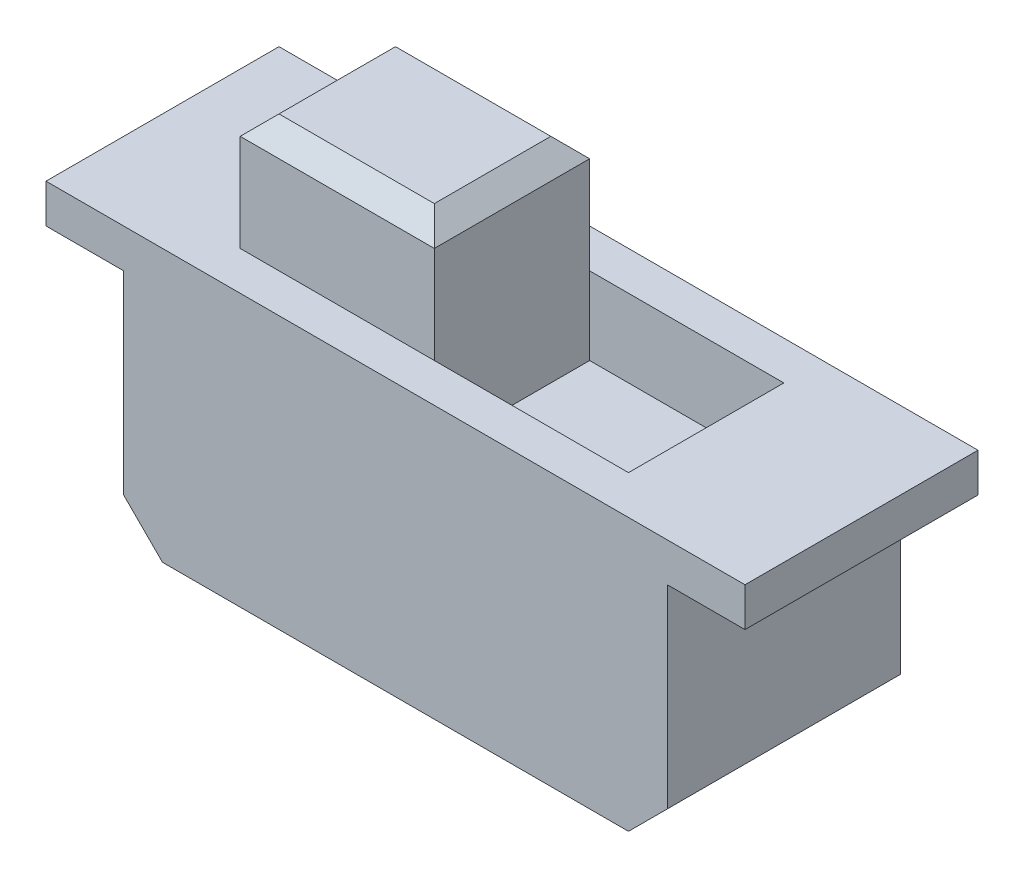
from build123d import *

# Parameters (mm, degrees)
EXTRUSION1_DEPTH        = 6
ESQUISSE2_W             = 10
ESQUISSE2_H             = 4
ENL_V_MAT_EXTRU_1_DEPTH = 2
ESQUISSE3_W             = 5
ESQUISSE3_H             = 4
EXTRUSION2_DEPTH        = 5
CHANFREIN1_SIZE         = 0.5


with BuildPart() as part:
    # Esquisse1 → Extrusion1 (new body)
    with BuildSketch(Plane.XY):
        Polygon((-9, 0), (9, 0), (9, -1), (7, -1), (7, -6), (6, -7), (-6, -7), (-7, -6), (-7, -1), (-9, -1), align=None)
    extrude(amount=EXTRUSION1_DEPTH)

    # Esquisse2 → Enl_v. mat.-Extru.1 (cut)
    with BuildSketch(Plane(origin=(0, 0, 0), x_dir=(-1, 0, 0), z_dir=(0, 1, 0))):
        with Locations((0, 3)):
            Rectangle(ESQUISSE2_W, ESQUISSE2_H)
    extrude(amount=-ENL_V_MAT_EXTRU_1_DEPTH, mode=Mode.SUBTRACT)

    # Esquisse3 → Extrusion2 (add)
    with BuildSketch(Plane(origin=(0, -2, 0), x_dir=(-1, 0, 0), z_dir=(0, 1, 0))):
        with Locations((2.5, 3)):
            Rectangle(ESQUISSE3_W, ESQUISSE3_H)
    extrude(amount=EXTRUSION2_DEPTH)

    # Chanfrein1
    chanfrein1_edges = [part.edges().sort_by_distance(p)[0] for p in [
        (-5, 3, 3),
        (-2.5, 3, 5),
        (0, 3, 3),
        (-2.5, 3, 1),
    ]]
    chamfer(chanfrein1_edges, length=CHANFREIN1_SIZE)


solid = part.part
